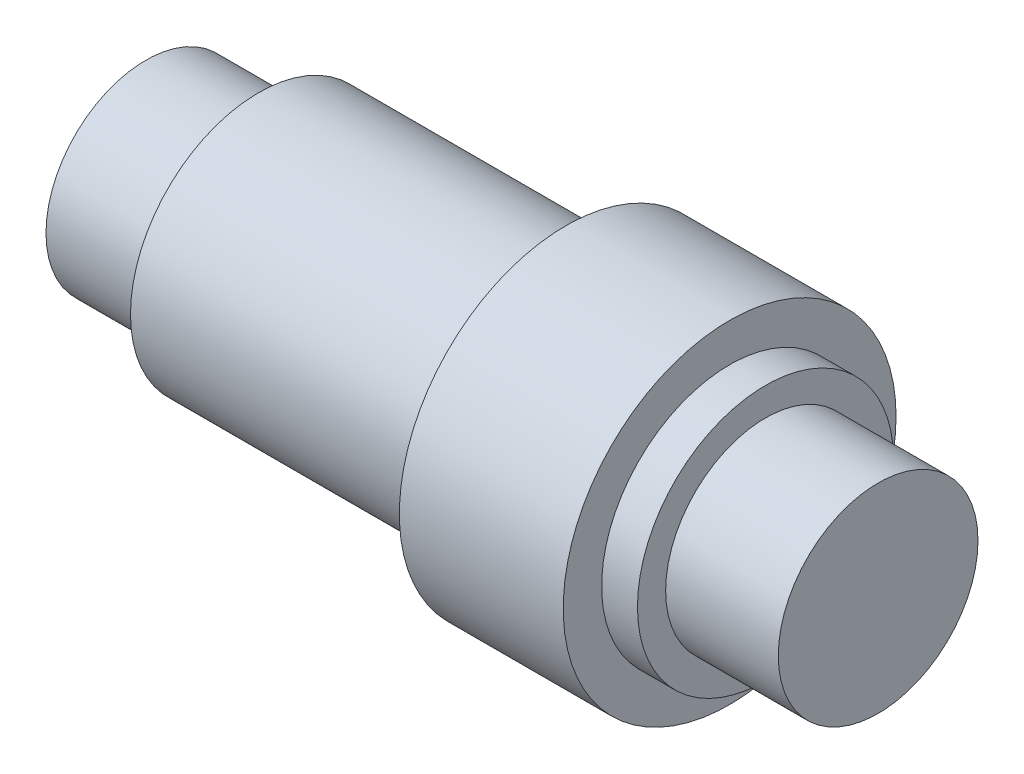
ISO-10303-21;
HEADER;
FILE_DESCRIPTION(('STEP AP214'),'2;1');
FILE_NAME('part.step','',(''),(''),'','','');
FILE_SCHEMA(('AUTOMOTIVE_DESIGN { 1 0 10303 214 1 1 1 1 }'));
ENDSEC;
DATA;
#1=APPLICATION_CONTEXT('core data for automotive mechanical design processes');
#2=APPLICATION_PROTOCOL_DEFINITION('international standard','automotive_design',2000,#1);
#3=PRODUCT_CONTEXT('',#1,'mechanical');
#4=PRODUCT('Part','Part','',(#3));
#5=PRODUCT_RELATED_PRODUCT_CATEGORY('part','',(#4));
#6=PRODUCT_DEFINITION_FORMATION('','',#4);
#7=PRODUCT_DEFINITION_CONTEXT('part definition',#1,'design');
#8=PRODUCT_DEFINITION('design','',#6,#7);
#9=PRODUCT_DEFINITION_SHAPE('','',#8);
#10=(LENGTH_UNIT() NAMED_UNIT(*) SI_UNIT(.MILLI.,.METRE.));
#11=(NAMED_UNIT(*) PLANE_ANGLE_UNIT() SI_UNIT($,.RADIAN.));
#12=(NAMED_UNIT(*) SI_UNIT($,.STERADIAN.) SOLID_ANGLE_UNIT());
#13=UNCERTAINTY_MEASURE_WITH_UNIT(LENGTH_MEASURE(1.E-05),#10,'distance_accuracy_value','');
#14=(GEOMETRIC_REPRESENTATION_CONTEXT(3) GLOBAL_UNCERTAINTY_ASSIGNED_CONTEXT((#13)) GLOBAL_UNIT_ASSIGNED_CONTEXT((#10,
#11,#12)) REPRESENTATION_CONTEXT('',''));
#15=CARTESIAN_POINT('',(0.,0.,0.));
#16=DIRECTION('',(0.,0.,1.));
#17=DIRECTION('',(1.,0.,0.));
#18=AXIS2_PLACEMENT_3D('',#15,#16,#17);
#19=CARTESIAN_POINT('',(4.25,0.,0.));
#20=DIRECTION('',(-1.,0.,0.));
#21=DIRECTION('',(0.,0.,1.));
#22=AXIS2_PLACEMENT_3D('',#19,#20,#21);
#23=CYLINDRICAL_SURFACE('',#22,3.25);
#24=CARTESIAN_POINT('',(4.25,0.,0.));
#25=DIRECTION('',(1.,0.,0.));
#26=DIRECTION('',(0.,0.,-1.));
#27=AXIS2_PLACEMENT_3D('',#24,#25,#26);
#28=CIRCLE('',#27,3.25);
#29=CARTESIAN_POINT('',(4.25,0.,-3.25));
#30=VERTEX_POINT('',#29);
#31=EDGE_CURVE('E44',#30,#30,#28,.T.);
#32=ORIENTED_EDGE('',*,*,#31,.F.);
#33=EDGE_LOOP('',(#32));
#34=FACE_BOUND('',#33,.T.);
#35=CARTESIAN_POINT('',(1.05,0.,0.));
#36=DIRECTION('',(1.,0.,0.));
#37=DIRECTION('',(0.,0.,-1.));
#38=AXIS2_PLACEMENT_3D('',#35,#36,#37);
#39=CIRCLE('',#38,3.25);
#40=CARTESIAN_POINT('',(1.05,0.,-3.25));
#41=VERTEX_POINT('',#40);
#42=EDGE_CURVE('E46',#41,#41,#39,.T.);
#43=ORIENTED_EDGE('',*,*,#42,.T.);
#44=EDGE_LOOP('',(#43));
#45=FACE_BOUND('',#44,.T.);
#46=ADVANCED_FACE('F33',(#34,#45),#23,.T.);
#47=CARTESIAN_POINT('',(4.25,0.,0.));
#48=DIRECTION('',(1.,0.,0.));
#49=DIRECTION('',(0.,0.,-1.));
#50=AXIS2_PLACEMENT_3D('',#47,#48,#49);
#51=PLANE('',#50);
#52=CARTESIAN_POINT('',(4.25000000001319,0.,0.));
#53=DIRECTION('',(1.,0.,0.));
#54=DIRECTION('',(0.,0.,-1.));
#55=AXIS2_PLACEMENT_3D('',#52,#53,#54);
#56=CIRCLE('',#55,2.5);
#57=CARTESIAN_POINT('',(4.25000000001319,0.,-2.5));
#58=VERTEX_POINT('',#57);
#59=EDGE_CURVE('E58',#58,#58,#56,.T.);
#60=ORIENTED_EDGE('',*,*,#59,.F.);
#61=EDGE_LOOP('',(#60));
#62=FACE_BOUND('',#61,.T.);
#63=ORIENTED_EDGE('',*,*,#31,.T.);
#64=EDGE_LOOP('',(#63));
#65=FACE_BOUND('',#64,.T.);
#66=ADVANCED_FACE('F89',(#62,#65),#51,.T.);
#67=CARTESIAN_POINT('',(1.05,0.,0.));
#68=DIRECTION('',(1.,0.,0.));
#69=DIRECTION('',(0.,0.,-1.));
#70=AXIS2_PLACEMENT_3D('',#67,#68,#69);
#71=PLANE('',#70);
#72=CARTESIAN_POINT('',(1.05000000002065,0.,0.));
#73=DIRECTION('',(1.,0.,0.));
#74=DIRECTION('',(0.,0.,-1.));
#75=AXIS2_PLACEMENT_3D('',#72,#73,#74);
#76=CIRCLE('',#75,2.5);
#77=CARTESIAN_POINT('',(1.05000000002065,0.,-2.5));
#78=VERTEX_POINT('',#77);
#79=EDGE_CURVE('E55',#78,#78,#76,.F.);
#80=ORIENTED_EDGE('',*,*,#79,.F.);
#81=EDGE_LOOP('',(#80));
#82=FACE_BOUND('',#81,.T.);
#83=ORIENTED_EDGE('',*,*,#42,.F.);
#84=EDGE_LOOP('',(#83));
#85=FACE_BOUND('',#84,.T.);
#86=ADVANCED_FACE('F95',(#82,#85),#71,.F.);
#87=CARTESIAN_POINT('',(500000.,0.,0.));
#88=DIRECTION('',(-1.,0.,0.));
#89=DIRECTION('',(0.,0.,1.));
#90=AXIS2_PLACEMENT_3D('',#87,#88,#89);
#91=CYLINDRICAL_SURFACE('',#90,2.5);
#92=CARTESIAN_POINT('',(-4.95,0.,0.));
#93=DIRECTION('',(-1.,0.,0.));
#94=DIRECTION('',(0.,0.,1.));
#95=AXIS2_PLACEMENT_3D('',#92,#93,#94);
#96=CIRCLE('',#95,2.5);
#97=CARTESIAN_POINT('',(-4.95,0.,2.5));
#98=VERTEX_POINT('',#97);
#99=EDGE_CURVE('E49',#98,#98,#96,.T.);
#100=ORIENTED_EDGE('',*,*,#99,.F.);
#101=EDGE_LOOP('',(#100));
#102=FACE_BOUND('',#101,.T.);
#103=ORIENTED_EDGE('',*,*,#79,.T.);
#104=EDGE_LOOP('',(#103));
#105=FACE_BOUND('',#104,.T.);
#106=ADVANCED_FACE('F104',(#102,#105),#91,.T.);
#107=CARTESIAN_POINT('',(-4.95,0.,0.));
#108=DIRECTION('',(-1.,0.,0.));
#109=DIRECTION('',(0.,0.,1.));
#110=AXIS2_PLACEMENT_3D('',#107,#108,#109);
#111=PLANE('',#110);
#112=CARTESIAN_POINT('',(-4.95,0.,0.));
#113=DIRECTION('',(-1.,0.,0.));
#114=DIRECTION('',(0.,0.,1.));
#115=AXIS2_PLACEMENT_3D('',#112,#113,#114);
#116=CIRCLE('',#115,1.95);
#117=CARTESIAN_POINT('',(-4.95,0.,1.95));
#118=VERTEX_POINT('',#117);
#119=EDGE_CURVE('E52',#118,#118,#116,.F.);
#120=ORIENTED_EDGE('',*,*,#119,.T.);
#121=EDGE_LOOP('',(#120));
#122=FACE_BOUND('',#121,.T.);
#123=ORIENTED_EDGE('',*,*,#99,.T.);
#124=EDGE_LOOP('',(#123));
#125=FACE_BOUND('',#124,.T.);
#126=ADVANCED_FACE('F102',(#122,#125),#111,.T.);
#127=CARTESIAN_POINT('',(-7.15,0.,0.));
#128=DIRECTION('',(1.,0.,0.));
#129=DIRECTION('',(0.,0.,-1.));
#130=AXIS2_PLACEMENT_3D('',#127,#128,#129);
#131=PLANE('',#130);
#132=CARTESIAN_POINT('',(-7.15,0.,0.));
#133=DIRECTION('',(1.,0.,0.));
#134=DIRECTION('',(0.,0.,-1.));
#135=AXIS2_PLACEMENT_3D('',#132,#133,#134);
#136=CIRCLE('',#135,1.95);
#137=CARTESIAN_POINT('',(-7.15,0.,-1.95));
#138=VERTEX_POINT('',#137);
#139=EDGE_CURVE('E37',#138,#138,#136,.T.);
#140=ORIENTED_EDGE('',*,*,#139,.F.);
#141=EDGE_LOOP('',(#140));
#142=FACE_BOUND('',#141,.T.);
#143=ADVANCED_FACE('F86',(#142),#131,.F.);
#144=CARTESIAN_POINT('',(7.15,0.,0.));
#145=DIRECTION('',(-1.,0.,0.));
#146=DIRECTION('',(0.,0.,1.));
#147=AXIS2_PLACEMENT_3D('',#144,#145,#146);
#148=CYLINDRICAL_SURFACE('',#147,1.95);
#149=ORIENTED_EDGE('',*,*,#119,.F.);
#150=EDGE_LOOP('',(#149));
#151=FACE_BOUND('',#150,.T.);
#152=ORIENTED_EDGE('',*,*,#139,.T.);
#153=EDGE_LOOP('',(#152));
#154=FACE_BOUND('',#153,.T.);
#155=ADVANCED_FACE('F77',(#151,#154),#148,.T.);
#156=CARTESIAN_POINT('',(-500000.,0.,0.));
#157=DIRECTION('',(1.,0.,0.));
#158=DIRECTION('',(0.,0.,-1.));
#159=AXIS2_PLACEMENT_3D('',#156,#157,#158);
#160=CYLINDRICAL_SURFACE('',#159,2.5);
#161=ORIENTED_EDGE('',*,*,#59,.T.);
#162=EDGE_LOOP('',(#161));
#163=FACE_BOUND('',#162,.T.);
#164=CARTESIAN_POINT('',(4.95,0.,0.));
#165=DIRECTION('',(-1.,0.,0.));
#166=DIRECTION('',(0.,0.,1.));
#167=AXIS2_PLACEMENT_3D('',#164,#165,#166);
#168=CIRCLE('',#167,2.5);
#169=CARTESIAN_POINT('',(4.95,0.,2.5));
#170=VERTEX_POINT('',#169);
#171=EDGE_CURVE('E66',#170,#170,#168,.T.);
#172=ORIENTED_EDGE('',*,*,#171,.T.);
#173=EDGE_LOOP('',(#172));
#174=FACE_BOUND('',#173,.T.);
#175=ADVANCED_FACE('F70',(#163,#174),#160,.T.);
#176=CARTESIAN_POINT('',(4.95,0.,0.));
#177=DIRECTION('',(1.,0.,0.));
#178=DIRECTION('',(0.,0.,1.));
#179=AXIS2_PLACEMENT_3D('',#176,#177,#178);
#180=PLANE('',#179);
#181=CARTESIAN_POINT('',(4.95,0.,0.));
#182=DIRECTION('',(1.,0.,0.));
#183=DIRECTION('',(0.,0.,-1.));
#184=AXIS2_PLACEMENT_3D('',#181,#182,#183);
#185=CIRCLE('',#184,1.95);
#186=CARTESIAN_POINT('',(4.95,0.,-1.95));
#187=VERTEX_POINT('',#186);
#188=EDGE_CURVE('E63',#187,#187,#185,.F.);
#189=ORIENTED_EDGE('',*,*,#188,.T.);
#190=EDGE_LOOP('',(#189));
#191=FACE_BOUND('',#190,.T.);
#192=ORIENTED_EDGE('',*,*,#171,.F.);
#193=EDGE_LOOP('',(#192));
#194=FACE_BOUND('',#193,.T.);
#195=ADVANCED_FACE('F72',(#191,#194),#180,.T.);
#196=CARTESIAN_POINT('',(7.15,0.,0.));
#197=DIRECTION('',(1.,0.,0.));
#198=DIRECTION('',(0.,0.,-1.));
#199=AXIS2_PLACEMENT_3D('',#196,#197,#198);
#200=PLANE('',#199);
#201=CARTESIAN_POINT('',(7.15,0.,0.));
#202=DIRECTION('',(1.,0.,0.));
#203=DIRECTION('',(0.,0.,-1.));
#204=AXIS2_PLACEMENT_3D('',#201,#202,#203);
#205=CIRCLE('',#204,1.95);
#206=CARTESIAN_POINT('',(7.15,0.,-1.95));
#207=VERTEX_POINT('',#206);
#208=EDGE_CURVE('E10',#207,#207,#205,.T.);
#209=ORIENTED_EDGE('',*,*,#208,.T.);
#210=EDGE_LOOP('',(#209));
#211=FACE_BOUND('',#210,.T.);
#212=ADVANCED_FACE('F74',(#211),#200,.T.);
#213=ORIENTED_EDGE('',*,*,#188,.F.);
#214=EDGE_LOOP('',(#213));
#215=FACE_BOUND('',#214,.T.);
#216=ORIENTED_EDGE('',*,*,#208,.F.);
#217=EDGE_LOOP('',(#216));
#218=FACE_BOUND('',#217,.T.);
#219=ADVANCED_FACE('F35',(#215,#218),#148,.T.);
#220=CLOSED_SHELL('',(#46,#66,#86,#106,#126,#143,#155,#175,#195,#212,#219));
#221=MANIFOLD_SOLID_BREP('B2',#220);
#222=ADVANCED_BREP_SHAPE_REPRESENTATION('',(#18,#221),#14);
#223=SHAPE_DEFINITION_REPRESENTATION(#9,#222);
ENDSEC;
END-ISO-10303-21;
